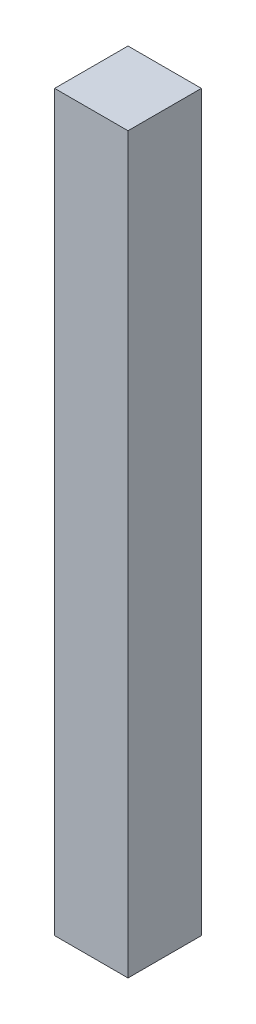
from build123d import *

# Parameters (mm, degrees)
SKETCH2_W           = 10
SKETCH2_H           = 10
BOSS_EXTRUDE1_DEPTH = 100


with BuildPart() as part:
    # Sketch2 → Boss-Extrude1 (new body)
    with BuildSketch(Plane(origin=(0, 0, 0), x_dir=(1, 0, 0), z_dir=(0, 1, 0))):
        with Locations((5, 5)):
            Rectangle(SKETCH2_W, SKETCH2_H)
    extrude(amount=BOSS_EXTRUDE1_DEPTH)


solid = part.part
